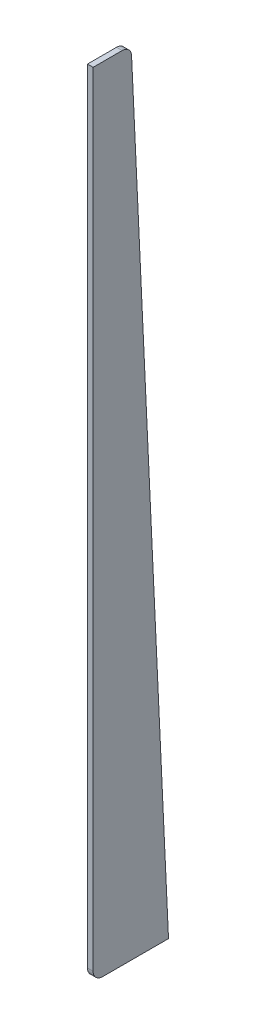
ISO-10303-21;
HEADER;
FILE_DESCRIPTION(('STEP AP214'),'2;1');
FILE_NAME('part.step','',(''),(''),'','','');
FILE_SCHEMA(('AUTOMOTIVE_DESIGN { 1 0 10303 214 1 1 1 1 }'));
ENDSEC;
DATA;
#1=APPLICATION_CONTEXT('core data for automotive mechanical design processes');
#2=APPLICATION_PROTOCOL_DEFINITION('international standard','automotive_design',2000,#1);
#3=PRODUCT_CONTEXT('',#1,'mechanical');
#4=PRODUCT('Part','Part','',(#3));
#5=PRODUCT_RELATED_PRODUCT_CATEGORY('part','',(#4));
#6=PRODUCT_DEFINITION_FORMATION('','',#4);
#7=PRODUCT_DEFINITION_CONTEXT('part definition',#1,'design');
#8=PRODUCT_DEFINITION('design','',#6,#7);
#9=PRODUCT_DEFINITION_SHAPE('','',#8);
#10=(LENGTH_UNIT() NAMED_UNIT(*) SI_UNIT(.MILLI.,.METRE.));
#11=(NAMED_UNIT(*) PLANE_ANGLE_UNIT() SI_UNIT($,.RADIAN.));
#12=(NAMED_UNIT(*) SI_UNIT($,.STERADIAN.) SOLID_ANGLE_UNIT());
#13=UNCERTAINTY_MEASURE_WITH_UNIT(LENGTH_MEASURE(1.E-05),#10,'distance_accuracy_value','');
#14=(GEOMETRIC_REPRESENTATION_CONTEXT(3) GLOBAL_UNCERTAINTY_ASSIGNED_CONTEXT((#13)) GLOBAL_UNIT_ASSIGNED_CONTEXT((#10,
#11,#12)) REPRESENTATION_CONTEXT('',''));
#15=CARTESIAN_POINT('',(0.,0.,0.));
#16=DIRECTION('',(0.,0.,1.));
#17=DIRECTION('',(1.,0.,0.));
#18=AXIS2_PLACEMENT_3D('',#15,#16,#17);
#19=CARTESIAN_POINT('',(3.,-415.5,0.));
#20=DIRECTION('',(0.,0.,-1.));
#21=DIRECTION('',(-1.,0.,0.));
#22=AXIS2_PLACEMENT_3D('',#19,#20,#21);
#23=PLANE('',#22);
#24=DIRECTION('',(0.,-1.,0.));
#25=VECTOR('',#24,1.);
#26=CARTESIAN_POINT('',(0.,-415.5,0.));
#27=LINE('',#26,#25);
#28=CARTESIAN_POINT('',(0.,0.,0.));
#29=VERTEX_POINT('',#28);
#30=CARTESIAN_POINT('',(0.,-415.5,0.));
#31=VERTEX_POINT('',#30);
#32=EDGE_CURVE('E86',#29,#31,#27,.T.);
#33=ORIENTED_EDGE('',*,*,#32,.T.);
#34=DIRECTION('',(-1.,0.,0.));
#35=VECTOR('',#34,1.);
#36=CARTESIAN_POINT('',(3.,-415.5,0.));
#37=LINE('',#36,#35);
#38=CARTESIAN_POINT('',(3.,-415.5,0.));
#39=VERTEX_POINT('',#38);
#40=EDGE_CURVE('E11',#39,#31,#37,.T.);
#41=ORIENTED_EDGE('',*,*,#40,.F.);
#42=DIRECTION('',(0.,-1.,0.));
#43=VECTOR('',#42,1.);
#44=CARTESIAN_POINT('',(3.,-415.5,0.));
#45=LINE('',#44,#43);
#46=CARTESIAN_POINT('',(3.,0.,0.));
#47=VERTEX_POINT('',#46);
#48=EDGE_CURVE('E109',#47,#39,#45,.T.);
#49=ORIENTED_EDGE('',*,*,#48,.F.);
#50=DIRECTION('',(-1.,0.,0.));
#51=VECTOR('',#50,1.);
#52=CARTESIAN_POINT('',(3.,0.,0.));
#53=LINE('',#52,#51);
#54=EDGE_CURVE('E99',#47,#29,#53,.T.);
#55=ORIENTED_EDGE('',*,*,#54,.T.);
#56=EDGE_LOOP('',(#33,#41,#49,#55));
#57=FACE_BOUND('',#56,.T.);
#58=ADVANCED_FACE('F30',(#57),#23,.F.);
#59=CARTESIAN_POINT('',(3.,-415.5,-5.));
#60=DIRECTION('',(-1.,0.,0.));
#61=DIRECTION('',(0.,0.,1.));
#62=AXIS2_PLACEMENT_3D('',#59,#60,#61);
#63=CYLINDRICAL_SURFACE('',#62,5.);
#64=CARTESIAN_POINT('',(0.,-415.5,-5.));
#65=DIRECTION('',(1.,0.,0.));
#66=DIRECTION('',(0.,0.,1.));
#67=AXIS2_PLACEMENT_3D('',#64,#65,#66);
#68=CIRCLE('',#67,5.);
#69=CARTESIAN_POINT('',(0.,-420.5,-5.));
#70=VERTEX_POINT('',#69);
#71=EDGE_CURVE('E82',#31,#70,#68,.T.);
#72=ORIENTED_EDGE('',*,*,#71,.T.);
#73=DIRECTION('',(-1.,0.,0.));
#74=VECTOR('',#73,1.);
#75=CARTESIAN_POINT('',(3.,-420.5,-5.));
#76=LINE('',#75,#74);
#77=CARTESIAN_POINT('',(3.,-420.5,-5.));
#78=VERTEX_POINT('',#77);
#79=EDGE_CURVE('E37',#78,#70,#76,.T.);
#80=ORIENTED_EDGE('',*,*,#79,.F.);
#81=CARTESIAN_POINT('',(3.,-415.5,-5.));
#82=DIRECTION('',(1.,0.,0.));
#83=DIRECTION('',(0.,0.,1.));
#84=AXIS2_PLACEMENT_3D('',#81,#82,#83);
#85=CIRCLE('',#84,5.);
#86=EDGE_CURVE('E95',#39,#78,#85,.T.);
#87=ORIENTED_EDGE('',*,*,#86,.F.);
#88=ORIENTED_EDGE('',*,*,#40,.T.);
#89=EDGE_LOOP('',(#72,#80,#87,#88));
#90=FACE_BOUND('',#89,.T.);
#91=ADVANCED_FACE('F94',(#90),#63,.T.);
#92=CARTESIAN_POINT('',(3.,-420.5,-40.));
#93=DIRECTION('',(0.,1.,0.));
#94=DIRECTION('',(0.,0.,1.));
#95=AXIS2_PLACEMENT_3D('',#92,#93,#94);
#96=PLANE('',#95);
#97=DIRECTION('',(0.,0.,-1.));
#98=VECTOR('',#97,1.);
#99=CARTESIAN_POINT('',(0.,-420.5,-40.));
#100=LINE('',#99,#98);
#101=CARTESIAN_POINT('',(0.,-420.5,-40.));
#102=VERTEX_POINT('',#101);
#103=EDGE_CURVE('E88',#70,#102,#100,.T.);
#104=ORIENTED_EDGE('',*,*,#103,.T.);
#105=DIRECTION('',(-1.,0.,0.));
#106=VECTOR('',#105,1.);
#107=CARTESIAN_POINT('',(3.,-420.5,-40.));
#108=LINE('',#107,#106);
#109=CARTESIAN_POINT('',(3.,-420.5,-40.));
#110=VERTEX_POINT('',#109);
#111=EDGE_CURVE('E125',#110,#102,#108,.T.);
#112=ORIENTED_EDGE('',*,*,#111,.F.);
#113=DIRECTION('',(0.,0.,-1.));
#114=VECTOR('',#113,1.);
#115=CARTESIAN_POINT('',(3.,-420.5,-40.));
#116=LINE('',#115,#114);
#117=EDGE_CURVE('E112',#78,#110,#116,.T.);
#118=ORIENTED_EDGE('',*,*,#117,.F.);
#119=ORIENTED_EDGE('',*,*,#79,.T.);
#120=EDGE_LOOP('',(#104,#112,#118,#119));
#121=FACE_BOUND('',#120,.T.);
#122=ADVANCED_FACE('F129',(#121),#96,.F.);
#123=CARTESIAN_POINT('',(3.,-4.76446774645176,-20.3944099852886));
#124=DIRECTION('',(0.,-0.0471064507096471,0.99888987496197));
#125=DIRECTION('',(0.,-0.99888987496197,-0.0471064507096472));
#126=AXIS2_PLACEMENT_3D('',#123,#124,#125);
#127=PLANE('',#126);
#128=DIRECTION('',(0.,0.99888987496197,0.0471064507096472));
#129=VECTOR('',#128,1.);
#130=CARTESIAN_POINT('',(0.,-4.76446774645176,-20.3944099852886));
#131=LINE('',#130,#129);
#132=CARTESIAN_POINT('',(0.,-4.76446774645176,-20.3944099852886));
#133=VERTEX_POINT('',#132);
#134=EDGE_CURVE('E103',#102,#133,#131,.T.);
#135=ORIENTED_EDGE('',*,*,#134,.T.);
#136=DIRECTION('',(-1.,0.,0.));
#137=VECTOR('',#136,1.);
#138=CARTESIAN_POINT('',(3.,-4.76446774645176,-20.3944099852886));
#139=LINE('',#138,#137);
#140=CARTESIAN_POINT('',(3.,-4.76446774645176,-20.3944099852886));
#141=VERTEX_POINT('',#140);
#142=EDGE_CURVE('E122',#141,#133,#139,.T.);
#143=ORIENTED_EDGE('',*,*,#142,.F.);
#144=DIRECTION('',(0.,0.99888987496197,0.0471064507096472));
#145=VECTOR('',#144,1.);
#146=CARTESIAN_POINT('',(3.,-4.76446774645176,-20.3944099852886));
#147=LINE('',#146,#145);
#148=EDGE_CURVE('E114',#110,#141,#147,.T.);
#149=ORIENTED_EDGE('',*,*,#148,.F.);
#150=ORIENTED_EDGE('',*,*,#111,.T.);
#151=EDGE_LOOP('',(#135,#143,#149,#150));
#152=FACE_BOUND('',#151,.T.);
#153=ADVANCED_FACE('F135',(#152),#127,.F.);
#154=CARTESIAN_POINT('',(3.,-5.,-15.3999606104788));
#155=DIRECTION('',(-1.,0.,0.));
#156=DIRECTION('',(0.,0.,1.));
#157=AXIS2_PLACEMENT_3D('',#154,#155,#156);
#158=CYLINDRICAL_SURFACE('',#157,5.);
#159=CARTESIAN_POINT('',(0.,-5.,-15.3999606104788));
#160=DIRECTION('',(1.,0.,0.));
#161=DIRECTION('',(0.,0.,1.));
#162=AXIS2_PLACEMENT_3D('',#159,#160,#161);
#163=CIRCLE('',#162,5.);
#164=CARTESIAN_POINT('',(0.,0.,-15.3999606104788));
#165=VERTEX_POINT('',#164);
#166=EDGE_CURVE('E105',#133,#165,#163,.T.);
#167=ORIENTED_EDGE('',*,*,#166,.T.);
#168=DIRECTION('',(-1.,0.,0.));
#169=VECTOR('',#168,1.);
#170=CARTESIAN_POINT('',(3.,0.,-15.3999606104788));
#171=LINE('',#170,#169);
#172=CARTESIAN_POINT('',(3.,0.,-15.3999606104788));
#173=VERTEX_POINT('',#172);
#174=EDGE_CURVE('E119',#173,#165,#171,.T.);
#175=ORIENTED_EDGE('',*,*,#174,.F.);
#176=CARTESIAN_POINT('',(3.,-5.,-15.3999606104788));
#177=DIRECTION('',(1.,0.,0.));
#178=DIRECTION('',(0.,0.,1.));
#179=AXIS2_PLACEMENT_3D('',#176,#177,#178);
#180=CIRCLE('',#179,5.);
#181=EDGE_CURVE('E49',#141,#173,#180,.T.);
#182=ORIENTED_EDGE('',*,*,#181,.F.);
#183=ORIENTED_EDGE('',*,*,#142,.T.);
#184=EDGE_LOOP('',(#167,#175,#182,#183));
#185=FACE_BOUND('',#184,.T.);
#186=ADVANCED_FACE('F138',(#185),#158,.T.);
#187=CARTESIAN_POINT('',(3.,0.,0.));
#188=DIRECTION('',(0.,-1.,0.));
#189=DIRECTION('',(0.,0.,-1.));
#190=AXIS2_PLACEMENT_3D('',#187,#188,#189);
#191=PLANE('',#190);
#192=DIRECTION('',(0.,0.,1.));
#193=VECTOR('',#192,1.);
#194=CARTESIAN_POINT('',(0.,0.,0.));
#195=LINE('',#194,#193);
#196=EDGE_CURVE('E107',#165,#29,#195,.T.);
#197=ORIENTED_EDGE('',*,*,#196,.T.);
#198=ORIENTED_EDGE('',*,*,#54,.F.);
#199=DIRECTION('',(0.,0.,1.));
#200=VECTOR('',#199,1.);
#201=CARTESIAN_POINT('',(3.,0.,0.));
#202=LINE('',#201,#200);
#203=EDGE_CURVE('E44',#173,#47,#202,.T.);
#204=ORIENTED_EDGE('',*,*,#203,.F.);
#205=ORIENTED_EDGE('',*,*,#174,.T.);
#206=EDGE_LOOP('',(#197,#198,#204,#205));
#207=FACE_BOUND('',#206,.T.);
#208=ADVANCED_FACE('F140',(#207),#191,.F.);
#209=CARTESIAN_POINT('',(3.,-5.,-15.3999606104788));
#210=DIRECTION('',(-1.,0.,0.));
#211=DIRECTION('',(0.,0.,1.));
#212=AXIS2_PLACEMENT_3D('',#209,#210,#211);
#213=PLANE('',#212);
#214=ORIENTED_EDGE('',*,*,#48,.T.);
#215=ORIENTED_EDGE('',*,*,#86,.T.);
#216=ORIENTED_EDGE('',*,*,#117,.T.);
#217=ORIENTED_EDGE('',*,*,#148,.T.);
#218=ORIENTED_EDGE('',*,*,#181,.T.);
#219=ORIENTED_EDGE('',*,*,#203,.T.);
#220=EDGE_LOOP('',(#214,#215,#216,#217,#218,#219));
#221=FACE_BOUND('',#220,.T.);
#222=ADVANCED_FACE('F132',(#221),#213,.F.);
#223=CARTESIAN_POINT('',(0.,-5.,-15.3999606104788));
#224=DIRECTION('',(-1.,0.,0.));
#225=DIRECTION('',(0.,0.,1.));
#226=AXIS2_PLACEMENT_3D('',#223,#224,#225);
#227=PLANE('',#226);
#228=ORIENTED_EDGE('',*,*,#32,.F.);
#229=ORIENTED_EDGE('',*,*,#196,.F.);
#230=ORIENTED_EDGE('',*,*,#166,.F.);
#231=ORIENTED_EDGE('',*,*,#134,.F.);
#232=ORIENTED_EDGE('',*,*,#103,.F.);
#233=ORIENTED_EDGE('',*,*,#71,.F.);
#234=EDGE_LOOP('',(#228,#229,#230,#231,#232,#233));
#235=FACE_BOUND('',#234,.T.);
#236=ADVANCED_FACE('F83',(#235),#227,.T.);
#237=CLOSED_SHELL('',(#58,#91,#122,#153,#186,#208,#222,#236));
#238=MANIFOLD_SOLID_BREP('B2',#237);
#239=ADVANCED_BREP_SHAPE_REPRESENTATION('',(#18,#238),#14);
#240=SHAPE_DEFINITION_REPRESENTATION(#9,#239);
ENDSEC;
END-ISO-10303-21;
